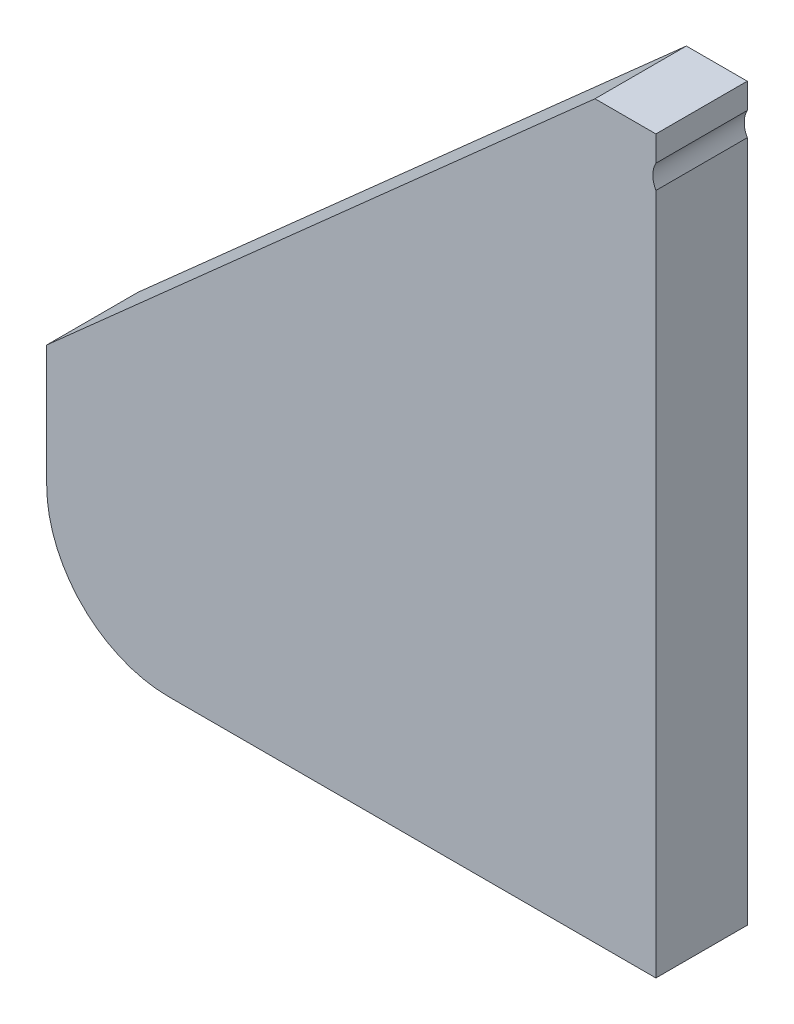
from build123d import *

# Parameters (mm, degrees)
BASE_EXTRUSION_DEPTH    = 15
ESQUISSE2_R             = 4
ENL_V_MAT_EXTRU_1_DEPTH = 157.923548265


with BuildPart() as part:
    # Esquisse1 → Base-Extrusion (new body)
    with BuildSketch(Plane.XY):
        with BuildLine():
            Line((-10, 120), (-100, 40))
            Line((-100, 40), (-100, 20))
            ThreePointArc((-100, 20), (-94.142135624, 5.857864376), (-80, 0))
            Line((-80, 0), (0, 0))
            Line((0, 0), (0, 120))
            Line((0, 120), (-10, 120))
        make_face()
    extrude(amount=BASE_EXTRUSION_DEPTH)

    # Esquisse2 → Enl_v. mat.-Extru.1 (cut, through all)
    with BuildSketch(Plane(origin=(0, 0, 0), x_dir=(-1, 0, 0), z_dir=(0, 0, -1))):
        with Locations((-3.5, 113.9)):
            Circle(ESQUISSE2_R)
    extrude(amount=-ENL_V_MAT_EXTRU_1_DEPTH, mode=Mode.SUBTRACT)


solid = part.part
